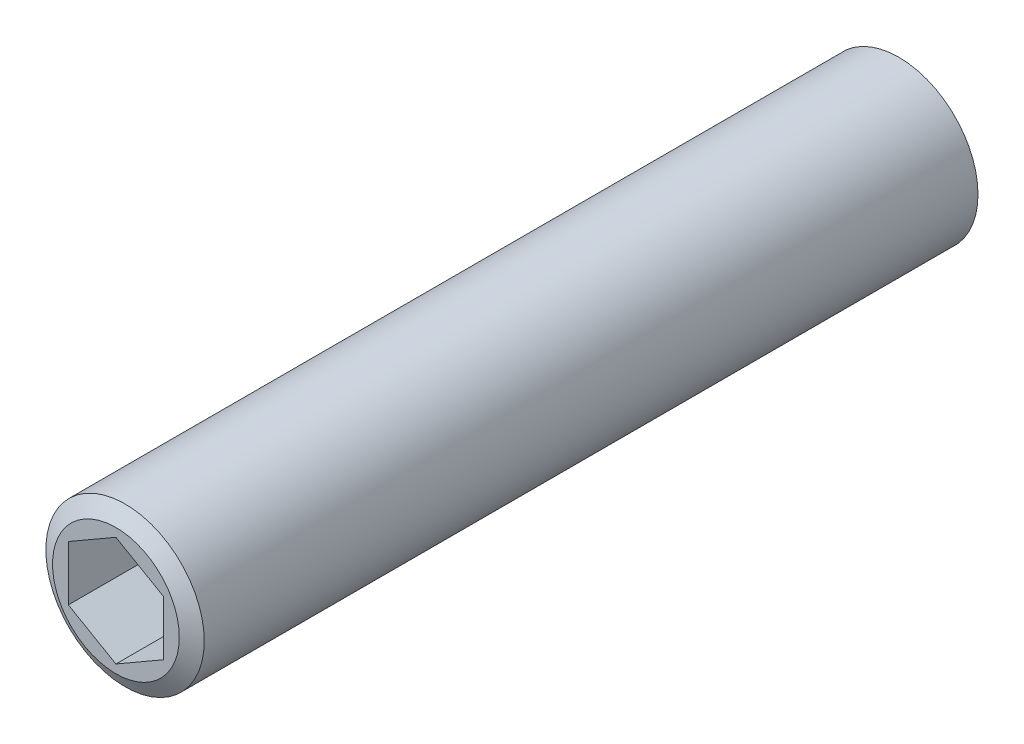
ISO-10303-21;
HEADER;
FILE_DESCRIPTION(('STEP AP214'),'2;1');
FILE_NAME('part.step','',(''),(''),'','','');
FILE_SCHEMA(('AUTOMOTIVE_DESIGN { 1 0 10303 214 1 1 1 1 }'));
ENDSEC;
DATA;
#1=APPLICATION_CONTEXT('core data for automotive mechanical design processes');
#2=APPLICATION_PROTOCOL_DEFINITION('international standard','automotive_design',2000,#1);
#3=PRODUCT_CONTEXT('',#1,'mechanical');
#4=PRODUCT('Part','Part','',(#3));
#5=PRODUCT_RELATED_PRODUCT_CATEGORY('part','',(#4));
#6=PRODUCT_DEFINITION_FORMATION('','',#4);
#7=PRODUCT_DEFINITION_CONTEXT('part definition',#1,'design');
#8=PRODUCT_DEFINITION('design','',#6,#7);
#9=PRODUCT_DEFINITION_SHAPE('','',#8);
#10=(LENGTH_UNIT() NAMED_UNIT(*) SI_UNIT(.MILLI.,.METRE.));
#11=(NAMED_UNIT(*) PLANE_ANGLE_UNIT() SI_UNIT($,.RADIAN.));
#12=(NAMED_UNIT(*) SI_UNIT($,.STERADIAN.) SOLID_ANGLE_UNIT());
#13=UNCERTAINTY_MEASURE_WITH_UNIT(LENGTH_MEASURE(1.E-05),#10,'distance_accuracy_value','');
#14=(GEOMETRIC_REPRESENTATION_CONTEXT(3) GLOBAL_UNCERTAINTY_ASSIGNED_CONTEXT((#13)) GLOBAL_UNIT_ASSIGNED_CONTEXT((#10,
#11,#12)) REPRESENTATION_CONTEXT('',''));
#15=CARTESIAN_POINT('',(0.,0.,0.));
#16=DIRECTION('',(0.,0.,1.));
#17=DIRECTION('',(1.,0.,0.));
#18=AXIS2_PLACEMENT_3D('',#15,#16,#17);
#19=CARTESIAN_POINT('',(5.,0.,1.27));
#20=DIRECTION('',(0.,0.,-1.));
#21=DIRECTION('',(-1.,0.,0.));
#22=AXIS2_PLACEMENT_3D('',#19,#20,#21);
#23=PLANE('',#22);
#24=CARTESIAN_POINT('',(0.,0.,1.27));
#25=DIRECTION('',(0.,0.,-1.));
#26=DIRECTION('',(-1.,0.,0.));
#27=AXIS2_PLACEMENT_3D('',#24,#25,#26);
#28=CIRCLE('',#27,4.);
#29=CARTESIAN_POINT('',(-4.,0.,1.27));
#30=VERTEX_POINT('',#29);
#31=EDGE_CURVE('E341',#30,#30,#28,.T.);
#32=ORIENTED_EDGE('',*,*,#31,.T.);
#33=EDGE_LOOP('',(#32));
#34=FACE_BOUND('',#33,.T.);
#35=CARTESIAN_POINT('',(0.,0.,1.27));
#36=DIRECTION('',(0.,0.,-1.));
#37=DIRECTION('',(-1.,0.,0.));
#38=AXIS2_PLACEMENT_3D('',#35,#36,#37);
#39=CIRCLE('',#38,3.95);
#40=CARTESIAN_POINT('',(-3.95,0.,1.27));
#41=VERTEX_POINT('',#40);
#42=EDGE_CURVE('E195',#41,#41,#39,.T.);
#43=ORIENTED_EDGE('',*,*,#42,.F.);
#44=EDGE_LOOP('',(#43));
#45=FACE_BOUND('',#44,.T.);
#46=ADVANCED_FACE('F15',(#34,#45),#23,.T.);
#47=CARTESIAN_POINT('',(0.,0.,46.27));
#48=DIRECTION('',(0.,0.,1.));
#49=DIRECTION('',(1.,0.,0.));
#50=AXIS2_PLACEMENT_3D('',#47,#48,#49);
#51=CYLINDRICAL_SURFACE('',#50,5.);
#52=CARTESIAN_POINT('',(0.,0.,50.6926497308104));
#53=DIRECTION('',(0.,0.,1.));
#54=DIRECTION('',(1.,0.,0.));
#55=AXIS2_PLACEMENT_3D('',#52,#53,#54);
#56=CIRCLE('',#55,5.);
#57=CARTESIAN_POINT('',(5.,0.,50.6926497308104));
#58=VERTEX_POINT('',#57);
#59=EDGE_CURVE('E9',#58,#58,#56,.F.);
#60=ORIENTED_EDGE('',*,*,#59,.T.);
#61=EDGE_LOOP('',(#60));
#62=FACE_BOUND('',#61,.T.);
#63=CARTESIAN_POINT('',(0.,0.,1.8473502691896));
#64=DIRECTION('',(0.,0.,-1.));
#65=DIRECTION('',(-1.,0.,0.));
#66=AXIS2_PLACEMENT_3D('',#63,#64,#65);
#67=CIRCLE('',#66,5.);
#68=CARTESIAN_POINT('',(-5.,0.,1.8473502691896));
#69=VERTEX_POINT('',#68);
#70=EDGE_CURVE('E337',#69,#69,#67,.F.);
#71=ORIENTED_EDGE('',*,*,#70,.T.);
#72=EDGE_LOOP('',(#71));
#73=FACE_BOUND('',#72,.T.);
#74=ADVANCED_FACE('F360',(#62,#73),#51,.T.);
#75=CARTESIAN_POINT('',(0.,0.,9.17));
#76=DIRECTION('',(0.,0.,-1.));
#77=DIRECTION('',(-1.,0.,0.));
#78=AXIS2_PLACEMENT_3D('',#75,#76,#77);
#79=CYLINDRICAL_SURFACE('',#78,3.95);
#80=ORIENTED_EDGE('',*,*,#42,.T.);
#81=EDGE_LOOP('',(#80));
#82=FACE_BOUND('',#81,.T.);
#83=CARTESIAN_POINT('',(0.,0.,1.5));
#84=DIRECTION('',(0.,0.,1.));
#85=DIRECTION('',(1.,0.,0.));
#86=AXIS2_PLACEMENT_3D('',#83,#84,#85);
#87=CIRCLE('',#86,3.95);
#88=CARTESIAN_POINT('',(-2.56953303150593,-3.,1.5));
#89=VERTEX_POINT('',#88);
#90=CARTESIAN_POINT('',(2.56953303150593,-3.,1.5));
#91=VERTEX_POINT('',#90);
#92=EDGE_CURVE('E210',#89,#91,#87,.T.);
#93=ORIENTED_EDGE('',*,*,#92,.T.);
#94=CARTESIAN_POINT('',(0.,0.,-1.5));
#95=DIRECTION('',(0.,0.707106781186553,0.707106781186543));
#96=DIRECTION('',(0.,0.707106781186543,-0.707106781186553));
#97=AXIS2_PLACEMENT_3D('',#94,#95,#96);
#98=ELLIPSE('',#97,5.58614357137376,3.95);
#99=CARTESIAN_POINT('',(2.79307178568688,-2.79307178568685,1.2930717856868));
#100=VERTEX_POINT('',#99);
#101=EDGE_CURVE('E333',#91,#100,#98,.T.);
#102=ORIENTED_EDGE('',*,*,#101,.T.);
#103=CARTESIAN_POINT('',(0.,0.,-1.5));
#104=DIRECTION('',(-0.707106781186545,0.,0.70710678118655));
#105=DIRECTION('',(-0.70710678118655,0.,-0.707106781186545));
#106=AXIS2_PLACEMENT_3D('',#103,#104,#105);
#107=ELLIPSE('',#106,5.58614357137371,3.95);
#108=CARTESIAN_POINT('',(3.,-2.56953303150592,1.5));
#109=VERTEX_POINT('',#108);
#110=EDGE_CURVE('E218',#100,#109,#107,.T.);
#111=ORIENTED_EDGE('',*,*,#110,.T.);
#112=CARTESIAN_POINT('',(3.,2.56953303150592,1.5));
#113=VERTEX_POINT('',#112);
#114=EDGE_CURVE('E226',#109,#113,#87,.T.);
#115=ORIENTED_EDGE('',*,*,#114,.T.);
#116=CARTESIAN_POINT('',(0.,0.,-1.5));
#117=DIRECTION('',(-0.707106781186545,0.,0.70710678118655));
#118=DIRECTION('',(-0.70710678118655,0.,-0.707106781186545));
#119=AXIS2_PLACEMENT_3D('',#116,#117,#118);
#120=ELLIPSE('',#119,5.58614357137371,3.95);
#121=CARTESIAN_POINT('',(2.79307178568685,2.79307178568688,1.2930717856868));
#122=VERTEX_POINT('',#121);
#123=EDGE_CURVE('E229',#113,#122,#120,.T.);
#124=ORIENTED_EDGE('',*,*,#123,.T.);
#125=CARTESIAN_POINT('',(0.,0.,-1.5));
#126=DIRECTION('',(0.,-0.70710678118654,0.707106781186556));
#127=DIRECTION('',(0.,-0.707106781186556,-0.707106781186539));
#128=AXIS2_PLACEMENT_3D('',#125,#126,#127);
#129=ELLIPSE('',#128,5.58614357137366,3.95);
#130=CARTESIAN_POINT('',(2.56953303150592,3.,1.5));
#131=VERTEX_POINT('',#130);
#132=EDGE_CURVE('E233',#122,#131,#129,.T.);
#133=ORIENTED_EDGE('',*,*,#132,.T.);
#134=CARTESIAN_POINT('',(-2.56953303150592,3.,1.5));
#135=VERTEX_POINT('',#134);
#136=EDGE_CURVE('E211',#131,#135,#87,.T.);
#137=ORIENTED_EDGE('',*,*,#136,.T.);
#138=CARTESIAN_POINT('',(0.,0.,-1.5));
#139=DIRECTION('',(0.,-0.70710678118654,0.707106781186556));
#140=DIRECTION('',(0.,-0.707106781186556,-0.707106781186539));
#141=AXIS2_PLACEMENT_3D('',#138,#139,#140);
#142=ELLIPSE('',#141,5.58614357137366,3.95);
#143=CARTESIAN_POINT('',(-2.79307178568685,2.79307178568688,1.2930717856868));
#144=VERTEX_POINT('',#143);
#145=EDGE_CURVE('E216',#135,#144,#142,.T.);
#146=ORIENTED_EDGE('',*,*,#145,.T.);
#147=CARTESIAN_POINT('',(0.,0.,-1.5));
#148=DIRECTION('',(0.707106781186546,0.,0.70710678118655));
#149=DIRECTION('',(0.70710678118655,0.,-0.707106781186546));
#150=AXIS2_PLACEMENT_3D('',#147,#148,#149);
#151=ELLIPSE('',#150,5.58614357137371,3.95);
#152=CARTESIAN_POINT('',(-3.,2.56953303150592,1.5));
#153=VERTEX_POINT('',#152);
#154=EDGE_CURVE('E237',#144,#153,#151,.T.);
#155=ORIENTED_EDGE('',*,*,#154,.T.);
#156=CARTESIAN_POINT('',(-3.,-2.56953303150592,1.5));
#157=VERTEX_POINT('',#156);
#158=EDGE_CURVE('E217',#153,#157,#87,.T.);
#159=ORIENTED_EDGE('',*,*,#158,.T.);
#160=CARTESIAN_POINT('',(0.,0.,-1.5));
#161=DIRECTION('',(0.707106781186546,0.,0.70710678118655));
#162=DIRECTION('',(0.70710678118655,0.,-0.707106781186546));
#163=AXIS2_PLACEMENT_3D('',#160,#161,#162);
#164=ELLIPSE('',#163,5.58614357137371,3.95);
#165=CARTESIAN_POINT('',(-2.79307178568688,-2.79307178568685,1.2930717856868));
#166=VERTEX_POINT('',#165);
#167=EDGE_CURVE('E39',#157,#166,#164,.T.);
#168=ORIENTED_EDGE('',*,*,#167,.T.);
#169=CARTESIAN_POINT('',(0.,0.,-1.5));
#170=DIRECTION('',(0.,0.707106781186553,0.707106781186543));
#171=DIRECTION('',(0.,0.707106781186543,-0.707106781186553));
#172=AXIS2_PLACEMENT_3D('',#169,#170,#171);
#173=ELLIPSE('',#172,5.58614357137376,3.95);
#174=EDGE_CURVE('E222',#166,#89,#173,.T.);
#175=ORIENTED_EDGE('',*,*,#174,.T.);
#176=EDGE_LOOP('',(#93,#102,#111,#115,#124,#133,#137,#146,#155,#159,#168,#175));
#177=FACE_BOUND('',#176,.T.);
#178=ADVANCED_FACE('F366',(#82,#177),#79,.F.);
#179=CARTESIAN_POINT('',(3.95,1.5,0.));
#180=DIRECTION('',(0.,0.707106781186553,0.707106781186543));
#181=DIRECTION('',(0.,0.707106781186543,-0.707106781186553));
#182=AXIS2_PLACEMENT_3D('',#179,#180,#181);
#183=PLANE('',#182);
#184=DIRECTION('',(-1.,0.,0.));
#185=VECTOR('',#184,1.);
#186=CARTESIAN_POINT('',(3.95,0.,1.5));
#187=LINE('',#186,#185);
#188=CARTESIAN_POINT('',(3.,0.,1.5));
#189=VERTEX_POINT('',#188);
#190=CARTESIAN_POINT('',(0.,0.,1.5));
#191=VERTEX_POINT('',#190);
#192=EDGE_CURVE('E248',#189,#191,#187,.T.);
#193=ORIENTED_EDGE('',*,*,#192,.T.);
#194=DIRECTION('',(-0.577350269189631,-0.577350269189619,0.577350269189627));
#195=VECTOR('',#194,1.);
#196=CARTESIAN_POINT('',(-0.316666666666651,-0.316666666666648,1.8166666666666));
#197=LINE('',#196,#195);
#198=CARTESIAN_POINT('',(1.5,1.5,0.));
#199=VERTEX_POINT('',#198);
#200=EDGE_CURVE('E295',#199,#191,#197,.T.);
#201=ORIENTED_EDGE('',*,*,#200,.F.);
#202=DIRECTION('',(-0.577350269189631,0.577350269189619,-0.577350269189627));
#203=VECTOR('',#202,1.);
#204=CARTESIAN_POINT('',(3.31666666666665,-0.316666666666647,1.8166666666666));
#205=LINE('',#204,#203);
#206=EDGE_CURVE('E299',#189,#199,#205,.T.);
#207=ORIENTED_EDGE('',*,*,#206,.F.);
#208=EDGE_LOOP('',(#193,#201,#207));
#209=FACE_BOUND('',#208,.T.);
#210=ADVANCED_FACE('F437',(#209),#183,.F.);
#211=CARTESIAN_POINT('',(-3.,0.,1.5));
#212=VERTEX_POINT('',#211);
#213=EDGE_CURVE('E244',#191,#212,#187,.T.);
#214=ORIENTED_EDGE('',*,*,#213,.T.);
#215=DIRECTION('',(-0.577350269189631,-0.577350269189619,0.577350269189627));
#216=VECTOR('',#215,1.);
#217=CARTESIAN_POINT('',(-4.31666666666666,-1.31666666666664,2.81666666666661));
#218=LINE('',#217,#216);
#219=CARTESIAN_POINT('',(-1.5,1.49999999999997,0.));
#220=VERTEX_POINT('',#219);
#221=EDGE_CURVE('E287',#220,#212,#218,.T.);
#222=ORIENTED_EDGE('',*,*,#221,.F.);
#223=DIRECTION('',(-0.577350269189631,0.577350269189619,-0.577350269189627));
#224=VECTOR('',#223,1.);
#225=CARTESIAN_POINT('',(0.316666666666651,-0.316666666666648,1.8166666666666));
#226=LINE('',#225,#224);
#227=EDGE_CURVE('E291',#191,#220,#226,.T.);
#228=ORIENTED_EDGE('',*,*,#227,.F.);
#229=EDGE_LOOP('',(#214,#222,#228));
#230=FACE_BOUND('',#229,.T.);
#231=ADVANCED_FACE('F471',(#230),#183,.F.);
#232=CARTESIAN_POINT('',(3.95,-1.5,0.));
#233=DIRECTION('',(0.,-0.707106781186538,0.707106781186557));
#234=DIRECTION('',(0.,0.707106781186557,0.707106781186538));
#235=AXIS2_PLACEMENT_3D('',#232,#233,#234);
#236=PLANE('',#235);
#237=DIRECTION('',(0.577350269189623,-0.577350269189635,-0.57735026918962));
#238=VECTOR('',#237,1.);
#239=CARTESIAN_POINT('',(2.31666666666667,-2.31666666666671,-0.816666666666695));
#240=LINE('',#239,#238);
#241=CARTESIAN_POINT('',(1.49999999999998,-1.5,0.));
#242=VERTEX_POINT('',#241);
#243=EDGE_CURVE('E279',#191,#242,#240,.T.);
#244=ORIENTED_EDGE('',*,*,#243,.F.);
#245=ORIENTED_EDGE('',*,*,#192,.F.);
#246=DIRECTION('',(0.577350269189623,0.577350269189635,0.577350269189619));
#247=VECTOR('',#246,1.);
#248=CARTESIAN_POINT('',(0.683333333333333,-2.31666666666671,-0.816666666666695));
#249=LINE('',#248,#247);
#250=EDGE_CURVE('E283',#242,#189,#249,.T.);
#251=ORIENTED_EDGE('',*,*,#250,.F.);
#252=EDGE_LOOP('',(#244,#245,#251));
#253=FACE_BOUND('',#252,.T.);
#254=ADVANCED_FACE('F441',(#253),#236,.F.);
#255=DIRECTION('',(0.577350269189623,-0.577350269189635,-0.57735026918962));
#256=VECTOR('',#255,1.);
#257=CARTESIAN_POINT('',(-1.68333333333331,-1.31666666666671,0.183333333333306));
#258=LINE('',#257,#256);
#259=CARTESIAN_POINT('',(-1.5,-1.5,0.));
#260=VERTEX_POINT('',#259);
#261=EDGE_CURVE('E272',#212,#260,#258,.T.);
#262=ORIENTED_EDGE('',*,*,#261,.F.);
#263=ORIENTED_EDGE('',*,*,#213,.F.);
#264=DIRECTION('',(0.577350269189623,0.577350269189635,0.57735026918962));
#265=VECTOR('',#264,1.);
#266=CARTESIAN_POINT('',(-2.31666666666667,-2.31666666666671,-0.816666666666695));
#267=LINE('',#266,#265);
#268=EDGE_CURVE('E275',#260,#191,#267,.T.);
#269=ORIENTED_EDGE('',*,*,#268,.F.);
#270=EDGE_LOOP('',(#262,#263,#269));
#271=FACE_BOUND('',#270,.T.);
#272=ADVANCED_FACE('F469',(#271),#236,.F.);
#273=CARTESIAN_POINT('',(-1.5,-3.95,0.));
#274=DIRECTION('',(-0.707106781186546,0.,0.70710678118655));
#275=DIRECTION('',(0.70710678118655,0.,0.707106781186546));
#276=AXIS2_PLACEMENT_3D('',#273,#274,#275);
#277=PLANE('',#276);
#278=ORIENTED_EDGE('',*,*,#227,.T.);
#279=DIRECTION('',(0.577350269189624,0.577350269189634,0.57735026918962));
#280=VECTOR('',#279,1.);
#281=CARTESIAN_POINT('',(-3.31666666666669,-0.316666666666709,-1.81666666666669));
#282=LINE('',#281,#280);
#283=CARTESIAN_POINT('',(0.,3.,1.5));
#284=VERTEX_POINT('',#283);
#285=EDGE_CURVE('E306',#220,#284,#282,.T.);
#286=ORIENTED_EDGE('',*,*,#285,.T.);
#287=DIRECTION('',(0.,1.,0.));
#288=VECTOR('',#287,1.);
#289=CARTESIAN_POINT('',(0.,-3.95,1.5));
#290=LINE('',#289,#288);
#291=EDGE_CURVE('E319',#191,#284,#290,.T.);
#292=ORIENTED_EDGE('',*,*,#291,.F.);
#293=EDGE_LOOP('',(#278,#286,#292));
#294=FACE_BOUND('',#293,.T.);
#295=ADVANCED_FACE('F451',(#294),#277,.F.);
#296=CARTESIAN_POINT('',(1.5,-3.95,0.));
#297=DIRECTION('',(0.707106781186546,0.,0.70710678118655));
#298=DIRECTION('',(0.70710678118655,0.,-0.707106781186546));
#299=AXIS2_PLACEMENT_3D('',#296,#297,#298);
#300=PLANE('',#299);
#301=ORIENTED_EDGE('',*,*,#291,.T.);
#302=DIRECTION('',(0.577350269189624,-0.577350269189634,-0.57735026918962));
#303=VECTOR('',#302,1.);
#304=CARTESIAN_POINT('',(3.31666666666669,-0.316666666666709,-1.81666666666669));
#305=LINE('',#304,#303);
#306=EDGE_CURVE('E310',#284,#199,#305,.T.);
#307=ORIENTED_EDGE('',*,*,#306,.T.);
#308=ORIENTED_EDGE('',*,*,#200,.T.);
#309=EDGE_LOOP('',(#301,#307,#308));
#310=FACE_BOUND('',#309,.T.);
#311=ADVANCED_FACE('F455',(#310),#300,.F.);
#312=DIRECTION('',(-0.577350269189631,0.577350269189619,-0.577350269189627));
#313=VECTOR('',#312,1.);
#314=CARTESIAN_POINT('',(-0.683333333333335,-2.31666666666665,0.816666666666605));
#315=LINE('',#314,#313);
#316=CARTESIAN_POINT('',(0.,-3.,1.5));
#317=VERTEX_POINT('',#316);
#318=EDGE_CURVE('E261',#317,#260,#315,.T.);
#319=ORIENTED_EDGE('',*,*,#318,.T.);
#320=ORIENTED_EDGE('',*,*,#268,.T.);
#321=EDGE_CURVE('E323',#317,#191,#290,.T.);
#322=ORIENTED_EDGE('',*,*,#321,.F.);
#323=EDGE_LOOP('',(#319,#320,#322));
#324=FACE_BOUND('',#323,.T.);
#325=ADVANCED_FACE('F487',(#324),#277,.F.);
#326=ORIENTED_EDGE('',*,*,#321,.T.);
#327=ORIENTED_EDGE('',*,*,#243,.T.);
#328=DIRECTION('',(-0.577350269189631,-0.577350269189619,0.577350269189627));
#329=VECTOR('',#328,1.);
#330=CARTESIAN_POINT('',(0.683333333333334,-2.31666666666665,0.816666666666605));
#331=LINE('',#330,#329);
#332=EDGE_CURVE('E265',#242,#317,#331,.T.);
#333=ORIENTED_EDGE('',*,*,#332,.T.);
#334=EDGE_LOOP('',(#326,#327,#333));
#335=FACE_BOUND('',#334,.T.);
#336=ADVANCED_FACE('F448',(#335),#300,.F.);
#337=CARTESIAN_POINT('',(-3.95,-3.95,1.5));
#338=DIRECTION('',(0.,0.,1.));
#339=DIRECTION('',(1.,0.,0.));
#340=AXIS2_PLACEMENT_3D('',#337,#338,#339);
#341=PLANE('',#340);
#342=DIRECTION('',(0.,1.,0.));
#343=VECTOR('',#342,1.);
#344=CARTESIAN_POINT('',(3.,-3.95,1.5));
#345=LINE('',#344,#343);
#346=EDGE_CURVE('E318',#189,#113,#345,.T.);
#347=ORIENTED_EDGE('',*,*,#346,.T.);
#348=ORIENTED_EDGE('',*,*,#114,.F.);
#349=EDGE_CURVE('E329',#109,#189,#345,.T.);
#350=ORIENTED_EDGE('',*,*,#349,.T.);
#351=EDGE_LOOP('',(#347,#348,#350));
#352=FACE_BOUND('',#351,.T.);
#353=ADVANCED_FACE('F431',(#352),#341,.F.);
#354=CARTESIAN_POINT('',(3.95,-3.,1.5));
#355=DIRECTION('',(0.,0.707106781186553,0.707106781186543));
#356=DIRECTION('',(0.,0.707106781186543,-0.707106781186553));
#357=AXIS2_PLACEMENT_3D('',#354,#355,#356);
#358=PLANE('',#357);
#359=ORIENTED_EDGE('',*,*,#101,.F.);
#360=DIRECTION('',(-1.,0.,0.));
#361=VECTOR('',#360,1.);
#362=CARTESIAN_POINT('',(3.95,-3.,1.5));
#363=LINE('',#362,#361);
#364=EDGE_CURVE('E249',#91,#317,#363,.T.);
#365=ORIENTED_EDGE('',*,*,#364,.T.);
#366=ORIENTED_EDGE('',*,*,#332,.F.);
#367=DIRECTION('',(-0.577350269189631,0.577350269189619,-0.577350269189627));
#368=VECTOR('',#367,1.);
#369=CARTESIAN_POINT('',(2.31666666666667,-2.31666666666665,0.816666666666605));
#370=LINE('',#369,#368);
#371=EDGE_CURVE('E269',#100,#242,#370,.T.);
#372=ORIENTED_EDGE('',*,*,#371,.F.);
#373=EDGE_LOOP('',(#359,#365,#366,#372));
#374=FACE_BOUND('',#373,.T.);
#375=ADVANCED_FACE('F414',(#374),#358,.F.);
#376=ORIENTED_EDGE('',*,*,#174,.F.);
#377=DIRECTION('',(-0.577350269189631,-0.577350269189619,0.577350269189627));
#378=VECTOR('',#377,1.);
#379=CARTESIAN_POINT('',(-3.31666666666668,-3.31666666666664,1.8166666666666));
#380=LINE('',#379,#378);
#381=EDGE_CURVE('E258',#260,#166,#380,.T.);
#382=ORIENTED_EDGE('',*,*,#381,.F.);
#383=ORIENTED_EDGE('',*,*,#318,.F.);
#384=EDGE_CURVE('E250',#317,#89,#363,.T.);
#385=ORIENTED_EDGE('',*,*,#384,.T.);
#386=EDGE_LOOP('',(#376,#382,#383,#385));
#387=FACE_BOUND('',#386,.T.);
#388=ADVANCED_FACE('F481',(#387),#358,.F.);
#389=ORIENTED_EDGE('',*,*,#92,.F.);
#390=ORIENTED_EDGE('',*,*,#384,.F.);
#391=ORIENTED_EDGE('',*,*,#364,.F.);
#392=EDGE_LOOP('',(#389,#390,#391));
#393=FACE_BOUND('',#392,.T.);
#394=ADVANCED_FACE('F418',(#393),#341,.F.);
#395=ORIENTED_EDGE('',*,*,#158,.F.);
#396=DIRECTION('',(0.,1.,0.));
#397=VECTOR('',#396,1.);
#398=CARTESIAN_POINT('',(-3.,-3.95,1.5));
#399=LINE('',#398,#397);
#400=EDGE_CURVE('E325',#212,#153,#399,.T.);
#401=ORIENTED_EDGE('',*,*,#400,.F.);
#402=EDGE_CURVE('E324',#157,#212,#399,.T.);
#403=ORIENTED_EDGE('',*,*,#402,.F.);
#404=EDGE_LOOP('',(#395,#401,#403));
#405=FACE_BOUND('',#404,.T.);
#406=ADVANCED_FACE('F406',(#405),#341,.F.);
#407=CARTESIAN_POINT('',(-3.,-3.95,1.5));
#408=DIRECTION('',(0.707106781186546,0.,0.70710678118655));
#409=DIRECTION('',(0.70710678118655,0.,-0.707106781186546));
#410=AXIS2_PLACEMENT_3D('',#407,#408,#409);
#411=PLANE('',#410);
#412=ORIENTED_EDGE('',*,*,#167,.F.);
#413=ORIENTED_EDGE('',*,*,#402,.T.);
#414=ORIENTED_EDGE('',*,*,#261,.T.);
#415=ORIENTED_EDGE('',*,*,#381,.T.);
#416=EDGE_LOOP('',(#412,#413,#414,#415));
#417=FACE_BOUND('',#416,.T.);
#418=ADVANCED_FACE('F393',(#417),#411,.F.);
#419=CARTESIAN_POINT('',(1.5,-3.95,0.));
#420=DIRECTION('',(-0.707106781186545,0.,0.70710678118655));
#421=DIRECTION('',(0.70710678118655,0.,0.707106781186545));
#422=AXIS2_PLACEMENT_3D('',#419,#420,#421);
#423=PLANE('',#422);
#424=ORIENTED_EDGE('',*,*,#110,.F.);
#425=ORIENTED_EDGE('',*,*,#371,.T.);
#426=ORIENTED_EDGE('',*,*,#250,.T.);
#427=ORIENTED_EDGE('',*,*,#349,.F.);
#428=EDGE_LOOP('',(#424,#425,#426,#427));
#429=FACE_BOUND('',#428,.T.);
#430=ADVANCED_FACE('F382',(#429),#423,.F.);
#431=CARTESIAN_POINT('',(3.95,1.5,0.));
#432=DIRECTION('',(0.,-0.70710678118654,0.707106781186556));
#433=DIRECTION('',(0.,0.707106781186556,0.707106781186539));
#434=AXIS2_PLACEMENT_3D('',#431,#432,#433);
#435=PLANE('',#434);
#436=ORIENTED_EDGE('',*,*,#145,.F.);
#437=DIRECTION('',(-1.,0.,0.));
#438=VECTOR('',#437,1.);
#439=CARTESIAN_POINT('',(3.95,3.,1.5));
#440=LINE('',#439,#438);
#441=EDGE_CURVE('E215',#284,#135,#440,.T.);
#442=ORIENTED_EDGE('',*,*,#441,.F.);
#443=ORIENTED_EDGE('',*,*,#285,.F.);
#444=DIRECTION('',(0.577350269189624,-0.577350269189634,-0.57735026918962));
#445=VECTOR('',#444,1.);
#446=CARTESIAN_POINT('',(-0.683333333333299,0.683333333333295,-0.816666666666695));
#447=LINE('',#446,#445);
#448=EDGE_CURVE('E303',#144,#220,#447,.T.);
#449=ORIENTED_EDGE('',*,*,#448,.F.);
#450=EDGE_LOOP('',(#436,#442,#443,#449));
#451=FACE_BOUND('',#450,.T.);
#452=ADVANCED_FACE('F397',(#451),#435,.F.);
#453=ORIENTED_EDGE('',*,*,#132,.F.);
#454=DIRECTION('',(0.577350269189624,0.577350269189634,0.57735026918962));
#455=VECTOR('',#454,1.);
#456=CARTESIAN_POINT('',(-0.316666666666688,-0.316666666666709,-1.81666666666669));
#457=LINE('',#456,#455);
#458=EDGE_CURVE('E314',#199,#122,#457,.T.);
#459=ORIENTED_EDGE('',*,*,#458,.F.);
#460=ORIENTED_EDGE('',*,*,#306,.F.);
#461=EDGE_CURVE('E254',#131,#284,#440,.T.);
#462=ORIENTED_EDGE('',*,*,#461,.F.);
#463=EDGE_LOOP('',(#453,#459,#460,#462));
#464=FACE_BOUND('',#463,.T.);
#465=ADVANCED_FACE('F403',(#464),#435,.F.);
#466=ORIENTED_EDGE('',*,*,#136,.F.);
#467=ORIENTED_EDGE('',*,*,#461,.T.);
#468=ORIENTED_EDGE('',*,*,#441,.T.);
#469=EDGE_LOOP('',(#466,#467,#468));
#470=FACE_BOUND('',#469,.T.);
#471=ADVANCED_FACE('F390',(#470),#341,.F.);
#472=ORIENTED_EDGE('',*,*,#154,.F.);
#473=ORIENTED_EDGE('',*,*,#448,.T.);
#474=ORIENTED_EDGE('',*,*,#221,.T.);
#475=ORIENTED_EDGE('',*,*,#400,.T.);
#476=EDGE_LOOP('',(#472,#473,#474,#475));
#477=FACE_BOUND('',#476,.T.);
#478=ADVANCED_FACE('F380',(#477),#411,.F.);
#479=ORIENTED_EDGE('',*,*,#123,.F.);
#480=ORIENTED_EDGE('',*,*,#346,.F.);
#481=ORIENTED_EDGE('',*,*,#206,.T.);
#482=ORIENTED_EDGE('',*,*,#458,.T.);
#483=EDGE_LOOP('',(#479,#480,#481,#482));
#484=FACE_BOUND('',#483,.T.);
#485=ADVANCED_FACE('F373',(#484),#423,.F.);
#486=CARTESIAN_POINT('',(0.,0.,1.8473502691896));
#487=DIRECTION('',(0.,0.,1.));
#488=DIRECTION('',(1.,0.,0.));
#489=AXIS2_PLACEMENT_3D('',#486,#487,#488);
#490=CONICAL_SURFACE('',#489,5.,1.04719755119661);
#491=ORIENTED_EDGE('',*,*,#31,.F.);
#492=EDGE_LOOP('',(#491));
#493=FACE_BOUND('',#492,.T.);
#494=ORIENTED_EDGE('',*,*,#70,.F.);
#495=EDGE_LOOP('',(#494));
#496=FACE_BOUND('',#495,.T.);
#497=ADVANCED_FACE('F371',(#493,#496),#490,.T.);
#498=CARTESIAN_POINT('',(0.,0.,51.27));
#499=DIRECTION('',(0.,0.,1.));
#500=DIRECTION('',(1.,0.,0.));
#501=AXIS2_PLACEMENT_3D('',#498,#499,#500);
#502=PLANE('',#501);
#503=CARTESIAN_POINT('',(0.,0.,51.27));
#504=DIRECTION('',(0.,0.,1.));
#505=DIRECTION('',(1.,0.,0.));
#506=AXIS2_PLACEMENT_3D('',#503,#504,#505);
#507=CIRCLE('',#506,4.);
#508=CARTESIAN_POINT('',(4.,0.,51.27));
#509=VERTEX_POINT('',#508);
#510=EDGE_CURVE('E24',#509,#509,#507,.T.);
#511=ORIENTED_EDGE('',*,*,#510,.T.);
#512=EDGE_LOOP('',(#511));
#513=FACE_BOUND('',#512,.T.);
#514=DIRECTION('',(-0.866025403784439,0.5,0.));
#515=VECTOR('',#514,1.);
#516=CARTESIAN_POINT('',(3.,1.73205080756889,51.27));
#517=LINE('',#516,#515);
#518=CARTESIAN_POINT('',(3.,1.73205080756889,51.27));
#519=VERTEX_POINT('',#518);
#520=CARTESIAN_POINT('',(0.,3.46410161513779,51.27));
#521=VERTEX_POINT('',#520);
#522=EDGE_CURVE('E31',#519,#521,#517,.T.);
#523=ORIENTED_EDGE('',*,*,#522,.F.);
#524=DIRECTION('',(0.,1.,0.));
#525=VECTOR('',#524,1.);
#526=CARTESIAN_POINT('',(3.,-1.73205080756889,51.27));
#527=LINE('',#526,#525);
#528=CARTESIAN_POINT('',(3.,-1.73205080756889,51.27));
#529=VERTEX_POINT('',#528);
#530=EDGE_CURVE('E157',#529,#519,#527,.T.);
#531=ORIENTED_EDGE('',*,*,#530,.F.);
#532=DIRECTION('',(0.866025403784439,0.5,0.));
#533=VECTOR('',#532,1.);
#534=CARTESIAN_POINT('',(0.,-3.46410161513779,51.27));
#535=LINE('',#534,#533);
#536=CARTESIAN_POINT('',(0.,-3.46410161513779,51.27));
#537=VERTEX_POINT('',#536);
#538=EDGE_CURVE('E162',#537,#529,#535,.T.);
#539=ORIENTED_EDGE('',*,*,#538,.F.);
#540=DIRECTION('',(0.866025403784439,-0.5,0.));
#541=VECTOR('',#540,1.);
#542=CARTESIAN_POINT('',(-3.,-1.73205080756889,51.27));
#543=LINE('',#542,#541);
#544=CARTESIAN_POINT('',(-3.,-1.73205080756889,51.27));
#545=VERTEX_POINT('',#544);
#546=EDGE_CURVE('E185',#545,#537,#543,.T.);
#547=ORIENTED_EDGE('',*,*,#546,.F.);
#548=DIRECTION('',(0.,-1.,0.));
#549=VECTOR('',#548,1.);
#550=CARTESIAN_POINT('',(-3.,1.73205080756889,51.27));
#551=LINE('',#550,#549);
#552=CARTESIAN_POINT('',(-3.,1.73205080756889,51.27));
#553=VERTEX_POINT('',#552);
#554=EDGE_CURVE('E181',#553,#545,#551,.T.);
#555=ORIENTED_EDGE('',*,*,#554,.F.);
#556=DIRECTION('',(-0.866025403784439,-0.5,0.));
#557=VECTOR('',#556,1.);
#558=CARTESIAN_POINT('',(0.,3.46410161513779,51.27));
#559=LINE('',#558,#557);
#560=EDGE_CURVE('E178',#521,#553,#559,.T.);
#561=ORIENTED_EDGE('',*,*,#560,.F.);
#562=EDGE_LOOP('',(#523,#531,#539,#547,#555,#561));
#563=FACE_BOUND('',#562,.T.);
#564=ADVANCED_FACE('F348',(#513,#563),#502,.T.);
#565=CARTESIAN_POINT('',(3.,1.73205080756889,46.27));
#566=DIRECTION('',(0.5,0.866025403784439,0.));
#567=DIRECTION('',(0.866025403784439,-0.5,0.));
#568=AXIS2_PLACEMENT_3D('',#565,#566,#567);
#569=PLANE('',#568);
#570=ORIENTED_EDGE('',*,*,#522,.T.);
#571=DIRECTION('',(0.,0.,1.));
#572=VECTOR('',#571,1.);
#573=CARTESIAN_POINT('',(0.,3.46410161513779,46.27));
#574=LINE('',#573,#572);
#575=CARTESIAN_POINT('',(0.,3.46410161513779,46.27));
#576=VERTEX_POINT('',#575);
#577=EDGE_CURVE('E131',#576,#521,#574,.T.);
#578=ORIENTED_EDGE('',*,*,#577,.F.);
#579=DIRECTION('',(-0.866025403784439,0.5,0.));
#580=VECTOR('',#579,1.);
#581=CARTESIAN_POINT('',(3.,1.73205080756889,46.27));
#582=LINE('',#581,#580);
#583=CARTESIAN_POINT('',(3.,1.73205080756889,46.27));
#584=VERTEX_POINT('',#583);
#585=EDGE_CURVE('E135',#584,#576,#582,.T.);
#586=ORIENTED_EDGE('',*,*,#585,.F.);
#587=DIRECTION('',(0.,0.,1.));
#588=VECTOR('',#587,1.);
#589=CARTESIAN_POINT('',(3.,1.73205080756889,46.27));
#590=LINE('',#589,#588);
#591=EDGE_CURVE('E192',#584,#519,#590,.T.);
#592=ORIENTED_EDGE('',*,*,#591,.T.);
#593=EDGE_LOOP('',(#570,#578,#586,#592));
#594=FACE_BOUND('',#593,.T.);
#595=ADVANCED_FACE('F133',(#594),#569,.F.);
#596=CARTESIAN_POINT('',(3.,-1.73205080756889,46.27));
#597=DIRECTION('',(1.,0.,0.));
#598=DIRECTION('',(0.,0.,-1.));
#599=AXIS2_PLACEMENT_3D('',#596,#597,#598);
#600=PLANE('',#599);
#601=ORIENTED_EDGE('',*,*,#530,.T.);
#602=ORIENTED_EDGE('',*,*,#591,.F.);
#603=DIRECTION('',(0.,1.,0.));
#604=VECTOR('',#603,1.);
#605=CARTESIAN_POINT('',(3.,-1.73205080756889,46.27));
#606=LINE('',#605,#604);
#607=CARTESIAN_POINT('',(3.,-1.73205080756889,46.27));
#608=VERTEX_POINT('',#607);
#609=EDGE_CURVE('E142',#608,#584,#606,.T.);
#610=ORIENTED_EDGE('',*,*,#609,.F.);
#611=DIRECTION('',(0.,0.,1.));
#612=VECTOR('',#611,1.);
#613=CARTESIAN_POINT('',(3.,-1.73205080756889,46.27));
#614=LINE('',#613,#612);
#615=EDGE_CURVE('E196',#608,#529,#614,.T.);
#616=ORIENTED_EDGE('',*,*,#615,.T.);
#617=EDGE_LOOP('',(#601,#602,#610,#616));
#618=FACE_BOUND('',#617,.T.);
#619=ADVANCED_FACE('F565',(#618),#600,.F.);
#620=CARTESIAN_POINT('',(0.,-3.46410161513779,46.27));
#621=DIRECTION('',(0.5,-0.866025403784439,0.));
#622=DIRECTION('',(-0.866025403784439,-0.5,0.));
#623=AXIS2_PLACEMENT_3D('',#620,#621,#622);
#624=PLANE('',#623);
#625=ORIENTED_EDGE('',*,*,#538,.T.);
#626=ORIENTED_EDGE('',*,*,#615,.F.);
#627=DIRECTION('',(0.866025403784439,0.5,0.));
#628=VECTOR('',#627,1.);
#629=CARTESIAN_POINT('',(0.,-3.46410161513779,46.27));
#630=LINE('',#629,#628);
#631=CARTESIAN_POINT('',(0.,-3.46410161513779,46.27));
#632=VERTEX_POINT('',#631);
#633=EDGE_CURVE('E171',#632,#608,#630,.T.);
#634=ORIENTED_EDGE('',*,*,#633,.F.);
#635=DIRECTION('',(0.,0.,1.));
#636=VECTOR('',#635,1.);
#637=CARTESIAN_POINT('',(0.,-3.46410161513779,46.27));
#638=LINE('',#637,#636);
#639=EDGE_CURVE('E199',#632,#537,#638,.T.);
#640=ORIENTED_EDGE('',*,*,#639,.T.);
#641=EDGE_LOOP('',(#625,#626,#634,#640));
#642=FACE_BOUND('',#641,.T.);
#643=ADVANCED_FACE('F574',(#642),#624,.F.);
#644=CARTESIAN_POINT('',(-3.,-1.73205080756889,46.27));
#645=DIRECTION('',(-0.5,-0.866025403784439,0.));
#646=DIRECTION('',(-0.866025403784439,0.5,0.));
#647=AXIS2_PLACEMENT_3D('',#644,#645,#646);
#648=PLANE('',#647);
#649=ORIENTED_EDGE('',*,*,#546,.T.);
#650=ORIENTED_EDGE('',*,*,#639,.F.);
#651=DIRECTION('',(0.866025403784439,-0.5,0.));
#652=VECTOR('',#651,1.);
#653=CARTESIAN_POINT('',(-3.,-1.73205080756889,46.27));
#654=LINE('',#653,#652);
#655=CARTESIAN_POINT('',(-3.,-1.73205080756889,46.27));
#656=VERTEX_POINT('',#655);
#657=EDGE_CURVE('E167',#656,#632,#654,.T.);
#658=ORIENTED_EDGE('',*,*,#657,.F.);
#659=DIRECTION('',(0.,0.,1.));
#660=VECTOR('',#659,1.);
#661=CARTESIAN_POINT('',(-3.,-1.73205080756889,46.27));
#662=LINE('',#661,#660);
#663=EDGE_CURVE('E202',#656,#545,#662,.T.);
#664=ORIENTED_EDGE('',*,*,#663,.T.);
#665=EDGE_LOOP('',(#649,#650,#658,#664));
#666=FACE_BOUND('',#665,.T.);
#667=ADVANCED_FACE('F584',(#666),#648,.F.);
#668=CARTESIAN_POINT('',(-3.,1.73205080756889,46.27));
#669=DIRECTION('',(-1.,0.,0.));
#670=DIRECTION('',(0.,0.,1.));
#671=AXIS2_PLACEMENT_3D('',#668,#669,#670);
#672=PLANE('',#671);
#673=ORIENTED_EDGE('',*,*,#554,.T.);
#674=ORIENTED_EDGE('',*,*,#663,.F.);
#675=DIRECTION('',(0.,-1.,0.));
#676=VECTOR('',#675,1.);
#677=CARTESIAN_POINT('',(-3.,1.73205080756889,46.27));
#678=LINE('',#677,#676);
#679=CARTESIAN_POINT('',(-3.,1.73205080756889,46.27));
#680=VERTEX_POINT('',#679);
#681=EDGE_CURVE('E151',#680,#656,#678,.T.);
#682=ORIENTED_EDGE('',*,*,#681,.F.);
#683=DIRECTION('',(0.,0.,1.));
#684=VECTOR('',#683,1.);
#685=CARTESIAN_POINT('',(-3.,1.73205080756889,46.27));
#686=LINE('',#685,#684);
#687=EDGE_CURVE('E141',#680,#553,#686,.T.);
#688=ORIENTED_EDGE('',*,*,#687,.T.);
#689=EDGE_LOOP('',(#673,#674,#682,#688));
#690=FACE_BOUND('',#689,.T.);
#691=ADVANCED_FACE('F594',(#690),#672,.F.);
#692=CARTESIAN_POINT('',(0.,3.46410161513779,46.27));
#693=DIRECTION('',(-0.5,0.866025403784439,0.));
#694=DIRECTION('',(0.866025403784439,0.5,0.));
#695=AXIS2_PLACEMENT_3D('',#692,#693,#694);
#696=PLANE('',#695);
#697=ORIENTED_EDGE('',*,*,#560,.T.);
#698=ORIENTED_EDGE('',*,*,#687,.F.);
#699=DIRECTION('',(-0.866025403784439,-0.5,0.));
#700=VECTOR('',#699,1.);
#701=CARTESIAN_POINT('',(0.,3.46410161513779,46.27));
#702=LINE('',#701,#700);
#703=EDGE_CURVE('E145',#576,#680,#702,.T.);
#704=ORIENTED_EDGE('',*,*,#703,.F.);
#705=ORIENTED_EDGE('',*,*,#577,.T.);
#706=EDGE_LOOP('',(#697,#698,#704,#705));
#707=FACE_BOUND('',#706,.T.);
#708=ADVANCED_FACE('F146',(#707),#696,.F.);
#709=CARTESIAN_POINT('',(0.,3.46410161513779,46.27));
#710=DIRECTION('',(0.,0.,1.));
#711=DIRECTION('',(1.,0.,0.));
#712=AXIS2_PLACEMENT_3D('',#709,#710,#711);
#713=PLANE('',#712);
#714=ORIENTED_EDGE('',*,*,#585,.T.);
#715=ORIENTED_EDGE('',*,*,#703,.T.);
#716=ORIENTED_EDGE('',*,*,#681,.T.);
#717=ORIENTED_EDGE('',*,*,#657,.T.);
#718=ORIENTED_EDGE('',*,*,#633,.T.);
#719=ORIENTED_EDGE('',*,*,#609,.T.);
#720=EDGE_LOOP('',(#714,#715,#716,#717,#718,#719));
#721=FACE_BOUND('',#720,.T.);
#722=ADVANCED_FACE('F153',(#721),#713,.T.);
#723=CARTESIAN_POINT('',(0.,0.,51.27));
#724=DIRECTION('',(0.,0.,-1.));
#725=DIRECTION('',(-1.,0.,0.));
#726=AXIS2_PLACEMENT_3D('',#723,#724,#725);
#727=CONICAL_SURFACE('',#726,4.,1.0471975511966);
#728=ORIENTED_EDGE('',*,*,#59,.F.);
#729=EDGE_LOOP('',(#728));
#730=FACE_BOUND('',#729,.T.);
#731=ORIENTED_EDGE('',*,*,#510,.F.);
#732=EDGE_LOOP('',(#731));
#733=FACE_BOUND('',#732,.T.);
#734=ADVANCED_FACE('F17',(#730,#733),#727,.T.);
#735=CLOSED_SHELL('',(#46,#74,#178,#210,#231,#254,#272,#295,#311,#325,#336,#353,#375,#388,#394,
#406,#418,#430,#452,#465,#471,#478,#485,#497,#564,#595,#619,#643,#667,#691,#708,#722,#734));
#736=MANIFOLD_SOLID_BREP('B1',#735);
#737=ADVANCED_BREP_SHAPE_REPRESENTATION('',(#18,#736),#14);
#738=SHAPE_DEFINITION_REPRESENTATION(#9,#737);
ENDSEC;
END-ISO-10303-21;
